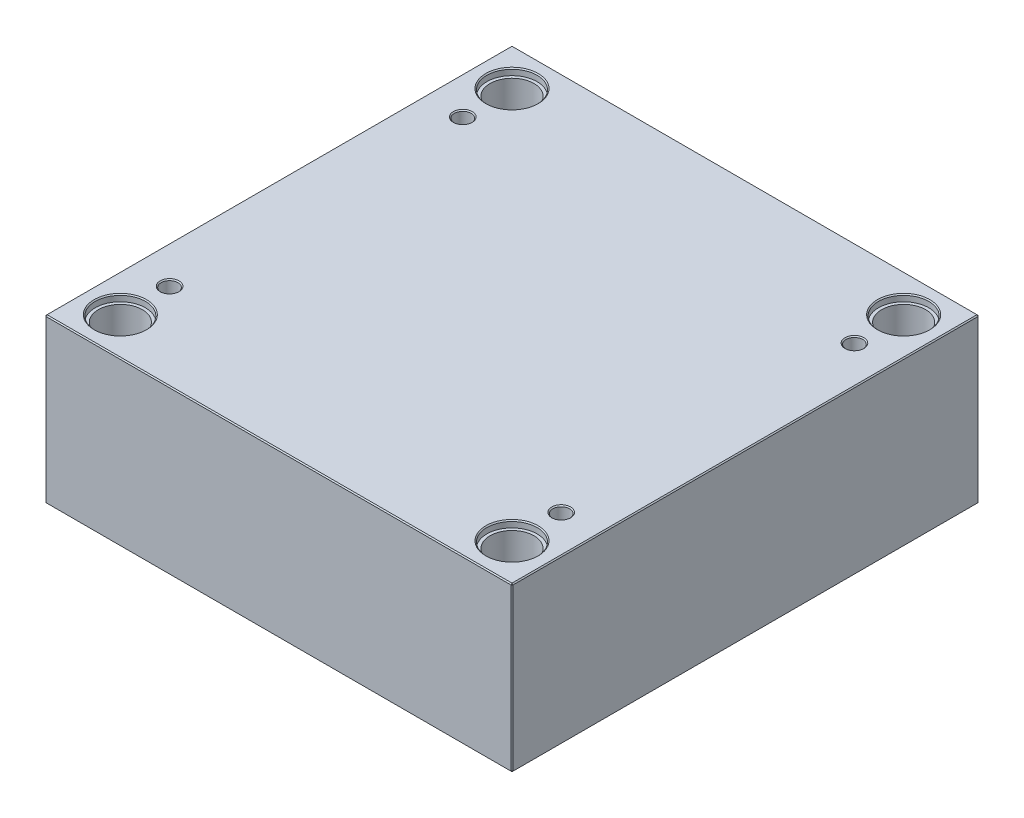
ISO-10303-21;
HEADER;
FILE_DESCRIPTION(('STEP AP214'),'2;1');
FILE_NAME('part.step','',(''),(''),'','','');
FILE_SCHEMA(('AUTOMOTIVE_DESIGN { 1 0 10303 214 1 1 1 1 }'));
ENDSEC;
DATA;
#1=APPLICATION_CONTEXT('core data for automotive mechanical design processes');
#2=APPLICATION_PROTOCOL_DEFINITION('international standard','automotive_design',2000,#1);
#3=PRODUCT_CONTEXT('',#1,'mechanical');
#4=PRODUCT('Part','Part','',(#3));
#5=PRODUCT_RELATED_PRODUCT_CATEGORY('part','',(#4));
#6=PRODUCT_DEFINITION_FORMATION('','',#4);
#7=PRODUCT_DEFINITION_CONTEXT('part definition',#1,'design');
#8=PRODUCT_DEFINITION('design','',#6,#7);
#9=PRODUCT_DEFINITION_SHAPE('','',#8);
#10=(LENGTH_UNIT() NAMED_UNIT(*) SI_UNIT(.MILLI.,.METRE.));
#11=(NAMED_UNIT(*) PLANE_ANGLE_UNIT() SI_UNIT($,.RADIAN.));
#12=(NAMED_UNIT(*) SI_UNIT($,.STERADIAN.) SOLID_ANGLE_UNIT());
#13=UNCERTAINTY_MEASURE_WITH_UNIT(LENGTH_MEASURE(1.E-05),#10,'distance_accuracy_value','');
#14=(GEOMETRIC_REPRESENTATION_CONTEXT(3) GLOBAL_UNCERTAINTY_ASSIGNED_CONTEXT((#13)) GLOBAL_UNIT_ASSIGNED_CONTEXT((#10,
#11,#12)) REPRESENTATION_CONTEXT('',''));
#15=CARTESIAN_POINT('',(0.,0.,0.));
#16=DIRECTION('',(0.,0.,1.));
#17=DIRECTION('',(1.,0.,0.));
#18=AXIS2_PLACEMENT_3D('',#15,#16,#17);
#19=CARTESIAN_POINT('',(-187.,0.,-187.));
#20=DIRECTION('',(0.,1.,0.));
#21=DIRECTION('',(0.,0.,1.));
#22=AXIS2_PLACEMENT_3D('',#19,#20,#21);
#23=CYLINDRICAL_SURFACE('',#22,21.);
#24=CARTESIAN_POINT('',(-187.,1.00000000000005,-187.));
#25=DIRECTION('',(0.,1.,0.));
#26=DIRECTION('',(0.,0.,1.));
#27=AXIS2_PLACEMENT_3D('',#24,#25,#26);
#28=CIRCLE('',#27,21.);
#29=CARTESIAN_POINT('',(-187.,1.00000000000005,-166.));
#30=VERTEX_POINT('',#29);
#31=EDGE_CURVE('E472',#30,#30,#28,.F.);
#32=ORIENTED_EDGE('',*,*,#31,.T.);
#33=EDGE_LOOP('',(#32));
#34=FACE_BOUND('',#33,.T.);
#35=CARTESIAN_POINT('',(-187.,149.7,-187.));
#36=DIRECTION('',(0.,1.,0.));
#37=DIRECTION('',(0.,0.,1.));
#38=AXIS2_PLACEMENT_3D('',#35,#36,#37);
#39=CIRCLE('',#38,21.);
#40=CARTESIAN_POINT('',(-187.,149.7,-166.));
#41=VERTEX_POINT('',#40);
#42=EDGE_CURVE('E221',#41,#41,#39,.F.);
#43=ORIENTED_EDGE('',*,*,#42,.F.);
#44=EDGE_LOOP('',(#43));
#45=FACE_BOUND('',#44,.T.);
#46=ADVANCED_FACE('F16',(#34,#45),#23,.F.);
#47=CARTESIAN_POINT('',(187.,0.,-187.));
#48=DIRECTION('',(0.,1.,0.));
#49=DIRECTION('',(0.,0.,1.));
#50=AXIS2_PLACEMENT_3D('',#47,#48,#49);
#51=CYLINDRICAL_SURFACE('',#50,21.);
#52=CARTESIAN_POINT('',(187.,1.00000000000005,-187.));
#53=DIRECTION('',(0.,1.,0.));
#54=DIRECTION('',(0.,0.,1.));
#55=AXIS2_PLACEMENT_3D('',#52,#53,#54);
#56=CIRCLE('',#55,21.);
#57=CARTESIAN_POINT('',(187.,1.00000000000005,-166.));
#58=VERTEX_POINT('',#57);
#59=EDGE_CURVE('E474',#58,#58,#56,.F.);
#60=ORIENTED_EDGE('',*,*,#59,.T.);
#61=EDGE_LOOP('',(#60));
#62=FACE_BOUND('',#61,.T.);
#63=CARTESIAN_POINT('',(187.,149.7,-187.));
#64=DIRECTION('',(0.,1.,0.));
#65=DIRECTION('',(0.,0.,1.));
#66=AXIS2_PLACEMENT_3D('',#63,#64,#65);
#67=CIRCLE('',#66,21.);
#68=CARTESIAN_POINT('',(187.,149.7,-166.));
#69=VERTEX_POINT('',#68);
#70=EDGE_CURVE('E218',#69,#69,#67,.F.);
#71=ORIENTED_EDGE('',*,*,#70,.F.);
#72=EDGE_LOOP('',(#71));
#73=FACE_BOUND('',#72,.T.);
#74=ADVANCED_FACE('F263',(#62,#73),#51,.F.);
#75=CARTESIAN_POINT('',(187.,0.,187.));
#76=DIRECTION('',(0.,1.,0.));
#77=DIRECTION('',(0.,0.,1.));
#78=AXIS2_PLACEMENT_3D('',#75,#76,#77);
#79=CYLINDRICAL_SURFACE('',#78,21.);
#80=CARTESIAN_POINT('',(187.,1.00000000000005,187.));
#81=DIRECTION('',(0.,1.,0.));
#82=DIRECTION('',(0.,0.,1.));
#83=AXIS2_PLACEMENT_3D('',#80,#81,#82);
#84=CIRCLE('',#83,21.);
#85=CARTESIAN_POINT('',(187.,1.00000000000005,208.));
#86=VERTEX_POINT('',#85);
#87=EDGE_CURVE('E477',#86,#86,#84,.F.);
#88=ORIENTED_EDGE('',*,*,#87,.T.);
#89=EDGE_LOOP('',(#88));
#90=FACE_BOUND('',#89,.T.);
#91=CARTESIAN_POINT('',(187.,149.7,187.));
#92=DIRECTION('',(0.,1.,0.));
#93=DIRECTION('',(0.,0.,1.));
#94=AXIS2_PLACEMENT_3D('',#91,#92,#93);
#95=CIRCLE('',#94,21.);
#96=CARTESIAN_POINT('',(187.,149.7,208.));
#97=VERTEX_POINT('',#96);
#98=EDGE_CURVE('E214',#97,#97,#95,.F.);
#99=ORIENTED_EDGE('',*,*,#98,.F.);
#100=EDGE_LOOP('',(#99));
#101=FACE_BOUND('',#100,.T.);
#102=ADVANCED_FACE('F270',(#90,#101),#79,.F.);
#103=CARTESIAN_POINT('',(-187.,0.,187.));
#104=DIRECTION('',(0.,1.,0.));
#105=DIRECTION('',(0.,0.,1.));
#106=AXIS2_PLACEMENT_3D('',#103,#104,#105);
#107=CYLINDRICAL_SURFACE('',#106,21.);
#108=CARTESIAN_POINT('',(-187.,1.00000000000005,187.));
#109=DIRECTION('',(0.,1.,0.));
#110=DIRECTION('',(0.,0.,1.));
#111=AXIS2_PLACEMENT_3D('',#108,#109,#110);
#112=CIRCLE('',#111,21.);
#113=CARTESIAN_POINT('',(-187.,1.00000000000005,208.));
#114=VERTEX_POINT('',#113);
#115=EDGE_CURVE('E480',#114,#114,#112,.F.);
#116=ORIENTED_EDGE('',*,*,#115,.T.);
#117=EDGE_LOOP('',(#116));
#118=FACE_BOUND('',#117,.T.);
#119=CARTESIAN_POINT('',(-187.,149.7,187.));
#120=DIRECTION('',(0.,1.,0.));
#121=DIRECTION('',(0.,0.,1.));
#122=AXIS2_PLACEMENT_3D('',#119,#120,#121);
#123=CIRCLE('',#122,21.);
#124=CARTESIAN_POINT('',(-187.,149.7,208.));
#125=VERTEX_POINT('',#124);
#126=EDGE_CURVE('E211',#125,#125,#123,.F.);
#127=ORIENTED_EDGE('',*,*,#126,.F.);
#128=EDGE_LOOP('',(#127));
#129=FACE_BOUND('',#128,.T.);
#130=ADVANCED_FACE('F277',(#118,#129),#107,.F.);
#131=CARTESIAN_POINT('',(-223.,156.,223.));
#132=DIRECTION('',(1.,0.,0.));
#133=DIRECTION('',(0.,0.,-1.));
#134=AXIS2_PLACEMENT_3D('',#131,#132,#133);
#135=PLANE('',#134);
#136=DIRECTION('',(0.,-1.,0.));
#137=VECTOR('',#136,1.);
#138=CARTESIAN_POINT('',(-223.,156.,-222.));
#139=LINE('',#138,#137);
#140=CARTESIAN_POINT('',(-223.,155.,-222.));
#141=VERTEX_POINT('',#140);
#142=CARTESIAN_POINT('',(-223.,1.00000000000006,-222.));
#143=VERTEX_POINT('',#142);
#144=EDGE_CURVE('E487',#141,#143,#139,.T.);
#145=ORIENTED_EDGE('',*,*,#144,.T.);
#146=DIRECTION('',(0.,0.,1.));
#147=VECTOR('',#146,1.);
#148=CARTESIAN_POINT('',(-223.,1.00000000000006,223.));
#149=LINE('',#148,#147);
#150=CARTESIAN_POINT('',(-223.,1.00000000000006,222.));
#151=VERTEX_POINT('',#150);
#152=EDGE_CURVE('E490',#143,#151,#149,.T.);
#153=ORIENTED_EDGE('',*,*,#152,.T.);
#154=DIRECTION('',(0.,1.,0.));
#155=VECTOR('',#154,1.);
#156=CARTESIAN_POINT('',(-223.,156.,222.));
#157=LINE('',#156,#155);
#158=CARTESIAN_POINT('',(-223.,155.,222.));
#159=VERTEX_POINT('',#158);
#160=EDGE_CURVE('E485',#151,#159,#157,.T.);
#161=ORIENTED_EDGE('',*,*,#160,.T.);
#162=DIRECTION('',(0.,0.,-1.));
#163=VECTOR('',#162,1.);
#164=CARTESIAN_POINT('',(-223.,155.,-223.));
#165=LINE('',#164,#163);
#166=EDGE_CURVE('E483',#159,#141,#165,.T.);
#167=ORIENTED_EDGE('',*,*,#166,.T.);
#168=EDGE_LOOP('',(#145,#153,#161,#167));
#169=FACE_BOUND('',#168,.T.);
#170=ADVANCED_FACE('F298',(#169),#135,.F.);
#171=CARTESIAN_POINT('',(223.,156.,223.));
#172=DIRECTION('',(0.,0.,-1.));
#173=DIRECTION('',(-1.,0.,0.));
#174=AXIS2_PLACEMENT_3D('',#171,#172,#173);
#175=PLANE('',#174);
#176=DIRECTION('',(-1.,0.,0.));
#177=VECTOR('',#176,1.);
#178=CARTESIAN_POINT('',(-223.,155.,223.));
#179=LINE('',#178,#177);
#180=CARTESIAN_POINT('',(222.,155.,223.));
#181=VERTEX_POINT('',#180);
#182=CARTESIAN_POINT('',(-222.,155.,223.));
#183=VERTEX_POINT('',#182);
#184=EDGE_CURVE('E509',#181,#183,#179,.T.);
#185=ORIENTED_EDGE('',*,*,#184,.T.);
#186=DIRECTION('',(0.,-1.,0.));
#187=VECTOR('',#186,1.);
#188=CARTESIAN_POINT('',(-222.,156.,223.));
#189=LINE('',#188,#187);
#190=CARTESIAN_POINT('',(-222.,1.,223.));
#191=VERTEX_POINT('',#190);
#192=EDGE_CURVE('E515',#183,#191,#189,.T.);
#193=ORIENTED_EDGE('',*,*,#192,.T.);
#194=DIRECTION('',(1.,0.,0.));
#195=VECTOR('',#194,1.);
#196=CARTESIAN_POINT('',(223.,1.,223.));
#197=LINE('',#196,#195);
#198=CARTESIAN_POINT('',(222.,1.,223.));
#199=VERTEX_POINT('',#198);
#200=EDGE_CURVE('E513',#191,#199,#197,.T.);
#201=ORIENTED_EDGE('',*,*,#200,.T.);
#202=DIRECTION('',(0.,1.,0.));
#203=VECTOR('',#202,1.);
#204=CARTESIAN_POINT('',(222.,156.,223.));
#205=LINE('',#204,#203);
#206=EDGE_CURVE('E511',#199,#181,#205,.T.);
#207=ORIENTED_EDGE('',*,*,#206,.T.);
#208=EDGE_LOOP('',(#185,#193,#201,#207));
#209=FACE_BOUND('',#208,.T.);
#210=ADVANCED_FACE('F294',(#209),#175,.F.);
#211=CARTESIAN_POINT('',(223.,156.,223.));
#212=DIRECTION('',(-1.,0.,0.));
#213=DIRECTION('',(0.,0.,1.));
#214=AXIS2_PLACEMENT_3D('',#211,#212,#213);
#215=PLANE('',#214);
#216=DIRECTION('',(0.,0.,-1.));
#217=VECTOR('',#216,1.);
#218=CARTESIAN_POINT('',(223.,1.,223.));
#219=LINE('',#218,#217);
#220=CARTESIAN_POINT('',(223.,1.,222.));
#221=VERTEX_POINT('',#220);
#222=CARTESIAN_POINT('',(223.,1.,-222.));
#223=VERTEX_POINT('',#222);
#224=EDGE_CURVE('E504',#221,#223,#219,.T.);
#225=ORIENTED_EDGE('',*,*,#224,.T.);
#226=DIRECTION('',(0.,1.,0.));
#227=VECTOR('',#226,1.);
#228=CARTESIAN_POINT('',(223.,156.,-222.));
#229=LINE('',#228,#227);
#230=CARTESIAN_POINT('',(223.,155.,-222.));
#231=VERTEX_POINT('',#230);
#232=EDGE_CURVE('E506',#223,#231,#229,.T.);
#233=ORIENTED_EDGE('',*,*,#232,.T.);
#234=DIRECTION('',(0.,0.,1.));
#235=VECTOR('',#234,1.);
#236=CARTESIAN_POINT('',(223.,155.,223.));
#237=LINE('',#236,#235);
#238=CARTESIAN_POINT('',(223.,155.,222.));
#239=VERTEX_POINT('',#238);
#240=EDGE_CURVE('E500',#231,#239,#237,.T.);
#241=ORIENTED_EDGE('',*,*,#240,.T.);
#242=DIRECTION('',(0.,-1.,0.));
#243=VECTOR('',#242,1.);
#244=CARTESIAN_POINT('',(223.,156.,222.));
#245=LINE('',#244,#243);
#246=EDGE_CURVE('E502',#239,#221,#245,.T.);
#247=ORIENTED_EDGE('',*,*,#246,.T.);
#248=EDGE_LOOP('',(#225,#233,#241,#247));
#249=FACE_BOUND('',#248,.T.);
#250=ADVANCED_FACE('F290',(#249),#215,.F.);
#251=CARTESIAN_POINT('',(223.,156.,-223.));
#252=DIRECTION('',(0.,0.,1.));
#253=DIRECTION('',(1.,0.,0.));
#254=AXIS2_PLACEMENT_3D('',#251,#252,#253);
#255=PLANE('',#254);
#256=DIRECTION('',(0.,-1.,0.));
#257=VECTOR('',#256,1.);
#258=CARTESIAN_POINT('',(222.,156.,-223.));
#259=LINE('',#258,#257);
#260=CARTESIAN_POINT('',(222.,155.,-223.));
#261=VERTEX_POINT('',#260);
#262=CARTESIAN_POINT('',(222.,1.,-223.));
#263=VERTEX_POINT('',#262);
#264=EDGE_CURVE('E494',#261,#263,#259,.T.);
#265=ORIENTED_EDGE('',*,*,#264,.T.);
#266=DIRECTION('',(-1.,0.,0.));
#267=VECTOR('',#266,1.);
#268=CARTESIAN_POINT('',(223.,1.,-223.));
#269=LINE('',#268,#267);
#270=CARTESIAN_POINT('',(-222.,1.,-223.));
#271=VERTEX_POINT('',#270);
#272=EDGE_CURVE('E138',#263,#271,#269,.T.);
#273=ORIENTED_EDGE('',*,*,#272,.T.);
#274=DIRECTION('',(0.,1.,0.));
#275=VECTOR('',#274,1.);
#276=CARTESIAN_POINT('',(-222.,156.,-223.));
#277=LINE('',#276,#275);
#278=CARTESIAN_POINT('',(-222.,155.,-223.));
#279=VERTEX_POINT('',#278);
#280=EDGE_CURVE('E496',#271,#279,#277,.T.);
#281=ORIENTED_EDGE('',*,*,#280,.T.);
#282=DIRECTION('',(1.,0.,0.));
#283=VECTOR('',#282,1.);
#284=CARTESIAN_POINT('',(223.,155.,-223.));
#285=LINE('',#284,#283);
#286=EDGE_CURVE('E492',#279,#261,#285,.T.);
#287=ORIENTED_EDGE('',*,*,#286,.T.);
#288=EDGE_LOOP('',(#265,#273,#281,#287));
#289=FACE_BOUND('',#288,.T.);
#290=ADVANCED_FACE('F282',(#289),#255,.F.);
#291=CARTESIAN_POINT('',(0.,156.,0.));
#292=DIRECTION('',(0.,1.,0.));
#293=DIRECTION('',(0.,0.,1.));
#294=AXIS2_PLACEMENT_3D('',#291,#292,#293);
#295=PLANE('',#294);
#296=CARTESIAN_POINT('',(187.,156.,187.));
#297=DIRECTION('',(0.,1.,0.));
#298=DIRECTION('',(0.,0.,1.));
#299=AXIS2_PLACEMENT_3D('',#296,#297,#298);
#300=CIRCLE('',#299,25.);
#301=CARTESIAN_POINT('',(187.,156.,212.));
#302=VERTEX_POINT('',#301);
#303=EDGE_CURVE('E236',#302,#302,#300,.F.);
#304=ORIENTED_EDGE('',*,*,#303,.T.);
#305=EDGE_LOOP('',(#304));
#306=FACE_BOUND('',#305,.T.);
#307=CARTESIAN_POINT('',(-187.,156.,187.));
#308=DIRECTION('',(0.,1.,0.));
#309=DIRECTION('',(0.,0.,1.));
#310=AXIS2_PLACEMENT_3D('',#307,#308,#309);
#311=CIRCLE('',#310,25.);
#312=CARTESIAN_POINT('',(-187.,156.,212.));
#313=VERTEX_POINT('',#312);
#314=EDGE_CURVE('E233',#313,#313,#311,.F.);
#315=ORIENTED_EDGE('',*,*,#314,.T.);
#316=EDGE_LOOP('',(#315));
#317=FACE_BOUND('',#316,.T.);
#318=CARTESIAN_POINT('',(187.,156.,-187.));
#319=DIRECTION('',(0.,1.,0.));
#320=DIRECTION('',(0.,0.,1.));
#321=AXIS2_PLACEMENT_3D('',#318,#319,#320);
#322=CIRCLE('',#321,25.);
#323=CARTESIAN_POINT('',(187.,156.,-162.));
#324=VERTEX_POINT('',#323);
#325=EDGE_CURVE('E230',#324,#324,#322,.F.);
#326=ORIENTED_EDGE('',*,*,#325,.T.);
#327=EDGE_LOOP('',(#326));
#328=FACE_BOUND('',#327,.T.);
#329=CARTESIAN_POINT('',(-187.,156.,-187.));
#330=DIRECTION('',(0.,1.,0.));
#331=DIRECTION('',(0.,0.,1.));
#332=AXIS2_PLACEMENT_3D('',#329,#330,#331);
#333=CIRCLE('',#332,25.);
#334=CARTESIAN_POINT('',(-187.,156.,-162.));
#335=VERTEX_POINT('',#334);
#336=EDGE_CURVE('E227',#335,#335,#333,.F.);
#337=ORIENTED_EDGE('',*,*,#336,.T.);
#338=EDGE_LOOP('',(#337));
#339=FACE_BOUND('',#338,.T.);
#340=CARTESIAN_POINT('',(-187.,156.,140.));
#341=DIRECTION('',(0.,1.,0.));
#342=DIRECTION('',(0.,0.,1.));
#343=AXIS2_PLACEMENT_3D('',#340,#341,#342);
#344=CIRCLE('',#343,9.);
#345=CARTESIAN_POINT('',(-187.,156.,149.));
#346=VERTEX_POINT('',#345);
#347=EDGE_CURVE('E198',#346,#346,#344,.F.);
#348=ORIENTED_EDGE('',*,*,#347,.T.);
#349=EDGE_LOOP('',(#348));
#350=FACE_BOUND('',#349,.T.);
#351=CARTESIAN_POINT('',(187.,156.,140.));
#352=DIRECTION('',(0.,1.,0.));
#353=DIRECTION('',(0.,0.,1.));
#354=AXIS2_PLACEMENT_3D('',#351,#352,#353);
#355=CIRCLE('',#354,9.);
#356=CARTESIAN_POINT('',(187.,156.,149.));
#357=VERTEX_POINT('',#356);
#358=EDGE_CURVE('E195',#357,#357,#355,.F.);
#359=ORIENTED_EDGE('',*,*,#358,.T.);
#360=EDGE_LOOP('',(#359));
#361=FACE_BOUND('',#360,.T.);
#362=CARTESIAN_POINT('',(187.,156.,-140.));
#363=DIRECTION('',(0.,1.,0.));
#364=DIRECTION('',(0.,0.,1.));
#365=AXIS2_PLACEMENT_3D('',#362,#363,#364);
#366=CIRCLE('',#365,9.);
#367=CARTESIAN_POINT('',(187.,156.,-131.));
#368=VERTEX_POINT('',#367);
#369=EDGE_CURVE('E192',#368,#368,#366,.F.);
#370=ORIENTED_EDGE('',*,*,#369,.T.);
#371=EDGE_LOOP('',(#370));
#372=FACE_BOUND('',#371,.T.);
#373=CARTESIAN_POINT('',(-187.,156.,-140.));
#374=DIRECTION('',(0.,1.,0.));
#375=DIRECTION('',(0.,0.,1.));
#376=AXIS2_PLACEMENT_3D('',#373,#374,#375);
#377=CIRCLE('',#376,9.);
#378=CARTESIAN_POINT('',(-187.,156.,-131.));
#379=VERTEX_POINT('',#378);
#380=EDGE_CURVE('E188',#379,#379,#377,.F.);
#381=ORIENTED_EDGE('',*,*,#380,.T.);
#382=EDGE_LOOP('',(#381));
#383=FACE_BOUND('',#382,.T.);
#384=DIRECTION('',(0.,0.,-1.));
#385=VECTOR('',#384,1.);
#386=CARTESIAN_POINT('',(222.,156.,-223.));
#387=LINE('',#386,#385);
#388=CARTESIAN_POINT('',(222.,156.,222.));
#389=VERTEX_POINT('',#388);
#390=CARTESIAN_POINT('',(222.,156.,-222.));
#391=VERTEX_POINT('',#390);
#392=EDGE_CURVE('E31',#389,#391,#387,.T.);
#393=ORIENTED_EDGE('',*,*,#392,.T.);
#394=DIRECTION('',(-1.,0.,0.));
#395=VECTOR('',#394,1.);
#396=CARTESIAN_POINT('',(-223.,156.,-222.));
#397=LINE('',#396,#395);
#398=CARTESIAN_POINT('',(-222.,156.,-222.));
#399=VERTEX_POINT('',#398);
#400=EDGE_CURVE('E189',#391,#399,#397,.T.);
#401=ORIENTED_EDGE('',*,*,#400,.T.);
#402=DIRECTION('',(0.,0.,1.));
#403=VECTOR('',#402,1.);
#404=CARTESIAN_POINT('',(-222.,156.,223.));
#405=LINE('',#404,#403);
#406=CARTESIAN_POINT('',(-222.,156.,222.));
#407=VERTEX_POINT('',#406);
#408=EDGE_CURVE('E518',#399,#407,#405,.T.);
#409=ORIENTED_EDGE('',*,*,#408,.T.);
#410=DIRECTION('',(1.,0.,0.));
#411=VECTOR('',#410,1.);
#412=CARTESIAN_POINT('',(223.,156.,222.));
#413=LINE('',#412,#411);
#414=EDGE_CURVE('E36',#407,#389,#413,.T.);
#415=ORIENTED_EDGE('',*,*,#414,.T.);
#416=EDGE_LOOP('',(#393,#401,#409,#415));
#417=FACE_BOUND('',#416,.T.);
#418=ADVANCED_FACE('F279',(#306,#317,#328,#339,#350,#361,#372,#383,#417),#295,.T.);
#419=CARTESIAN_POINT('',(0.,0.,0.));
#420=DIRECTION('',(0.,1.,0.));
#421=DIRECTION('',(0.,0.,1.));
#422=AXIS2_PLACEMENT_3D('',#419,#420,#421);
#423=PLANE('',#422);
#424=CARTESIAN_POINT('',(-187.,0.,-187.));
#425=DIRECTION('',(0.,1.,0.));
#426=DIRECTION('',(0.,0.,1.));
#427=AXIS2_PLACEMENT_3D('',#424,#425,#426);
#428=CIRCLE('',#427,22.);
#429=CARTESIAN_POINT('',(-187.,0.,-165.));
#430=VERTEX_POINT('',#429);
#431=EDGE_CURVE('E469',#430,#430,#428,.T.);
#432=ORIENTED_EDGE('',*,*,#431,.T.);
#433=EDGE_LOOP('',(#432));
#434=FACE_BOUND('',#433,.T.);
#435=CARTESIAN_POINT('',(187.,0.,-187.));
#436=DIRECTION('',(0.,1.,0.));
#437=DIRECTION('',(0.,0.,1.));
#438=AXIS2_PLACEMENT_3D('',#435,#436,#437);
#439=CIRCLE('',#438,22.);
#440=CARTESIAN_POINT('',(187.,0.,-165.));
#441=VERTEX_POINT('',#440);
#442=EDGE_CURVE('E466',#441,#441,#439,.T.);
#443=ORIENTED_EDGE('',*,*,#442,.T.);
#444=EDGE_LOOP('',(#443));
#445=FACE_BOUND('',#444,.T.);
#446=CARTESIAN_POINT('',(187.,0.,187.));
#447=DIRECTION('',(0.,1.,0.));
#448=DIRECTION('',(0.,0.,1.));
#449=AXIS2_PLACEMENT_3D('',#446,#447,#448);
#450=CIRCLE('',#449,22.);
#451=CARTESIAN_POINT('',(187.,0.,209.));
#452=VERTEX_POINT('',#451);
#453=EDGE_CURVE('E463',#452,#452,#450,.T.);
#454=ORIENTED_EDGE('',*,*,#453,.T.);
#455=EDGE_LOOP('',(#454));
#456=FACE_BOUND('',#455,.T.);
#457=CARTESIAN_POINT('',(-187.,0.,187.));
#458=DIRECTION('',(0.,1.,0.));
#459=DIRECTION('',(0.,0.,1.));
#460=AXIS2_PLACEMENT_3D('',#457,#458,#459);
#461=CIRCLE('',#460,22.);
#462=CARTESIAN_POINT('',(-187.,0.,209.));
#463=VERTEX_POINT('',#462);
#464=EDGE_CURVE('E460',#463,#463,#461,.T.);
#465=ORIENTED_EDGE('',*,*,#464,.T.);
#466=EDGE_LOOP('',(#465));
#467=FACE_BOUND('',#466,.T.);
#468=DIRECTION('',(0.,0.,1.));
#469=VECTOR('',#468,1.);
#470=CARTESIAN_POINT('',(222.,0.,0.));
#471=LINE('',#470,#469);
#472=CARTESIAN_POINT('',(222.,0.,-222.));
#473=VERTEX_POINT('',#472);
#474=CARTESIAN_POINT('',(222.,0.,222.));
#475=VERTEX_POINT('',#474);
#476=EDGE_CURVE('E108',#473,#475,#471,.T.);
#477=ORIENTED_EDGE('',*,*,#476,.T.);
#478=DIRECTION('',(-1.,0.,0.));
#479=VECTOR('',#478,1.);
#480=CARTESIAN_POINT('',(0.,0.,222.));
#481=LINE('',#480,#479);
#482=CARTESIAN_POINT('',(-222.,0.,222.));
#483=VERTEX_POINT('',#482);
#484=EDGE_CURVE('E458',#475,#483,#481,.T.);
#485=ORIENTED_EDGE('',*,*,#484,.T.);
#486=DIRECTION('',(0.,0.,-1.));
#487=VECTOR('',#486,1.);
#488=CARTESIAN_POINT('',(-222.,0.,0.));
#489=LINE('',#488,#487);
#490=CARTESIAN_POINT('',(-222.,0.,-222.));
#491=VERTEX_POINT('',#490);
#492=EDGE_CURVE('E110',#483,#491,#489,.T.);
#493=ORIENTED_EDGE('',*,*,#492,.T.);
#494=DIRECTION('',(1.,0.,0.));
#495=VECTOR('',#494,1.);
#496=CARTESIAN_POINT('',(0.,0.,-222.));
#497=LINE('',#496,#495);
#498=EDGE_CURVE('E104',#491,#473,#497,.T.);
#499=ORIENTED_EDGE('',*,*,#498,.T.);
#500=EDGE_LOOP('',(#477,#485,#493,#499));
#501=FACE_BOUND('',#500,.T.);
#502=ADVANCED_FACE('F106',(#434,#445,#456,#467,#501),#423,.F.);
#503=CARTESIAN_POINT('',(-187.,0.,-187.));
#504=DIRECTION('',(0.,-1.,0.));
#505=DIRECTION('',(0.,0.,-1.));
#506=AXIS2_PLACEMENT_3D('',#503,#504,#505);
#507=CONICAL_SURFACE('',#506,22.,0.785398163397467);
#508=ORIENTED_EDGE('',*,*,#31,.F.);
#509=EDGE_LOOP('',(#508));
#510=FACE_BOUND('',#509,.T.);
#511=ORIENTED_EDGE('',*,*,#431,.F.);
#512=EDGE_LOOP('',(#511));
#513=FACE_BOUND('',#512,.T.);
#514=ADVANCED_FACE('F286',(#510,#513),#507,.F.);
#515=CARTESIAN_POINT('',(187.,0.,-187.));
#516=DIRECTION('',(0.,-1.,0.));
#517=DIRECTION('',(0.,0.,-1.));
#518=AXIS2_PLACEMENT_3D('',#515,#516,#517);
#519=CONICAL_SURFACE('',#518,22.,0.785398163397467);
#520=ORIENTED_EDGE('',*,*,#59,.F.);
#521=EDGE_LOOP('',(#520));
#522=FACE_BOUND('',#521,.T.);
#523=ORIENTED_EDGE('',*,*,#442,.F.);
#524=EDGE_LOOP('',(#523));
#525=FACE_BOUND('',#524,.T.);
#526=ADVANCED_FACE('F305',(#522,#525),#519,.F.);
#527=CARTESIAN_POINT('',(187.,0.,187.));
#528=DIRECTION('',(0.,-1.,0.));
#529=DIRECTION('',(0.,0.,-1.));
#530=AXIS2_PLACEMENT_3D('',#527,#528,#529);
#531=CONICAL_SURFACE('',#530,22.,0.785398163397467);
#532=ORIENTED_EDGE('',*,*,#87,.F.);
#533=EDGE_LOOP('',(#532));
#534=FACE_BOUND('',#533,.T.);
#535=ORIENTED_EDGE('',*,*,#453,.F.);
#536=EDGE_LOOP('',(#535));
#537=FACE_BOUND('',#536,.T.);
#538=ADVANCED_FACE('F309',(#534,#537),#531,.F.);
#539=CARTESIAN_POINT('',(-187.,0.,187.));
#540=DIRECTION('',(0.,-1.,0.));
#541=DIRECTION('',(0.,0.,-1.));
#542=AXIS2_PLACEMENT_3D('',#539,#540,#541);
#543=CONICAL_SURFACE('',#542,22.,0.785398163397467);
#544=ORIENTED_EDGE('',*,*,#115,.F.);
#545=EDGE_LOOP('',(#544));
#546=FACE_BOUND('',#545,.T.);
#547=ORIENTED_EDGE('',*,*,#464,.F.);
#548=EDGE_LOOP('',(#547));
#549=FACE_BOUND('',#548,.T.);
#550=ADVANCED_FACE('F313',(#546,#549),#543,.F.);
#551=CARTESIAN_POINT('',(223.,156.,222.));
#552=DIRECTION('',(-0.707106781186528,0.,-0.707106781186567));
#553=DIRECTION('',(0.,-1.,0.));
#554=AXIS2_PLACEMENT_3D('',#551,#552,#553);
#555=PLANE('',#554);
#556=DIRECTION('',(-0.707106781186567,0.,0.707106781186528));
#557=VECTOR('',#556,1.);
#558=CARTESIAN_POINT('',(222.,155.,223.));
#559=LINE('',#558,#557);
#560=EDGE_CURVE('E126',#181,#239,#559,.F.);
#561=ORIENTED_EDGE('',*,*,#560,.F.);
#562=ORIENTED_EDGE('',*,*,#206,.F.);
#563=DIRECTION('',(0.707106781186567,0.,-0.707106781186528));
#564=VECTOR('',#563,1.);
#565=CARTESIAN_POINT('',(222.,1.,223.));
#566=LINE('',#565,#564);
#567=EDGE_CURVE('E180',#221,#199,#566,.F.);
#568=ORIENTED_EDGE('',*,*,#567,.F.);
#569=ORIENTED_EDGE('',*,*,#246,.F.);
#570=EDGE_LOOP('',(#561,#562,#568,#569));
#571=FACE_BOUND('',#570,.T.);
#572=ADVANCED_FACE('F317',(#571),#555,.F.);
#573=CARTESIAN_POINT('',(222.,155.,223.));
#574=DIRECTION('',(0.577350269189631,0.577350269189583,0.577350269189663));
#575=DIRECTION('',(0.707106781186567,0.,-0.707106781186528));
#576=AXIS2_PLACEMENT_3D('',#573,#574,#575);
#577=PLANE('',#576);
#578=DIRECTION('',(0.,-0.707106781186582,0.707106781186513));
#579=VECTOR('',#578,1.);
#580=CARTESIAN_POINT('',(222.,155.,223.));
#581=LINE('',#580,#579);
#582=EDGE_CURVE('E175',#181,#389,#581,.F.);
#583=ORIENTED_EDGE('',*,*,#582,.F.);
#584=ORIENTED_EDGE('',*,*,#560,.T.);
#585=DIRECTION('',(-0.707106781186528,0.707106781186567,0.));
#586=VECTOR('',#585,1.);
#587=CARTESIAN_POINT('',(222.5,155.5,222.));
#588=LINE('',#587,#586);
#589=EDGE_CURVE('E177',#389,#239,#588,.F.);
#590=ORIENTED_EDGE('',*,*,#589,.F.);
#591=EDGE_LOOP('',(#583,#584,#590));
#592=FACE_BOUND('',#591,.T.);
#593=ADVANCED_FACE('F385',(#592),#577,.T.);
#594=CARTESIAN_POINT('',(222.,1.,223.));
#595=DIRECTION('',(0.577350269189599,-0.577350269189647,0.577350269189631));
#596=DIRECTION('',(0.,-0.707106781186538,-0.707106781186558));
#597=AXIS2_PLACEMENT_3D('',#594,#595,#596);
#598=PLANE('',#597);
#599=DIRECTION('',(-0.707106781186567,-0.707106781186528,0.));
#600=VECTOR('',#599,1.);
#601=CARTESIAN_POINT('',(222.5,0.499999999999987,222.));
#602=LINE('',#601,#600);
#603=EDGE_CURVE('E124',#221,#475,#602,.T.);
#604=ORIENTED_EDGE('',*,*,#603,.F.);
#605=ORIENTED_EDGE('',*,*,#567,.T.);
#606=DIRECTION('',(0.,0.707106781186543,0.707106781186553));
#607=VECTOR('',#606,1.);
#608=CARTESIAN_POINT('',(222.,1.,223.));
#609=LINE('',#608,#607);
#610=EDGE_CURVE('E172',#475,#199,#609,.T.);
#611=ORIENTED_EDGE('',*,*,#610,.F.);
#612=EDGE_LOOP('',(#604,#605,#611));
#613=FACE_BOUND('',#612,.T.);
#614=ADVANCED_FACE('F381',(#613),#598,.T.);
#615=CARTESIAN_POINT('',(222.,156.,0.));
#616=DIRECTION('',(0.707106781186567,0.707106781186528,0.));
#617=DIRECTION('',(0.,0.,1.));
#618=AXIS2_PLACEMENT_3D('',#615,#616,#617);
#619=PLANE('',#618);
#620=ORIENTED_EDGE('',*,*,#589,.T.);
#621=ORIENTED_EDGE('',*,*,#240,.F.);
#622=DIRECTION('',(0.707106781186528,-0.707106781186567,0.));
#623=VECTOR('',#622,1.);
#624=CARTESIAN_POINT('',(223.,155.,-222.));
#625=LINE('',#624,#623);
#626=EDGE_CURVE('E166',#391,#231,#625,.T.);
#627=ORIENTED_EDGE('',*,*,#626,.F.);
#628=ORIENTED_EDGE('',*,*,#392,.F.);
#629=EDGE_LOOP('',(#620,#621,#627,#628));
#630=FACE_BOUND('',#629,.T.);
#631=ADVANCED_FACE('F377',(#630),#619,.T.);
#632=CARTESIAN_POINT('',(0.,156.,222.));
#633=DIRECTION('',(0.,0.707106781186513,0.707106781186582));
#634=DIRECTION('',(-1.,0.,0.));
#635=AXIS2_PLACEMENT_3D('',#632,#633,#634);
#636=PLANE('',#635);
#637=ORIENTED_EDGE('',*,*,#582,.T.);
#638=ORIENTED_EDGE('',*,*,#414,.F.);
#639=DIRECTION('',(0.,0.707106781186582,-0.707106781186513));
#640=VECTOR('',#639,1.);
#641=CARTESIAN_POINT('',(-222.,155.5,222.5));
#642=LINE('',#641,#640);
#643=EDGE_CURVE('E163',#183,#407,#642,.T.);
#644=ORIENTED_EDGE('',*,*,#643,.F.);
#645=ORIENTED_EDGE('',*,*,#184,.F.);
#646=EDGE_LOOP('',(#637,#638,#644,#645));
#647=FACE_BOUND('',#646,.T.);
#648=ADVANCED_FACE('F373',(#647),#636,.T.);
#649=CARTESIAN_POINT('',(-222.,156.,223.));
#650=DIRECTION('',(0.707106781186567,0.,-0.707106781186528));
#651=DIRECTION('',(0.,-1.,0.));
#652=AXIS2_PLACEMENT_3D('',#649,#650,#651);
#653=PLANE('',#652);
#654=DIRECTION('',(0.707106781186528,0.,0.707106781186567));
#655=VECTOR('',#654,1.);
#656=CARTESIAN_POINT('',(-222.,1.,223.));
#657=LINE('',#656,#655);
#658=EDGE_CURVE('E157',#191,#151,#657,.F.);
#659=ORIENTED_EDGE('',*,*,#658,.F.);
#660=ORIENTED_EDGE('',*,*,#192,.F.);
#661=DIRECTION('',(-0.707106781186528,0.,-0.707106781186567));
#662=VECTOR('',#661,1.);
#663=CARTESIAN_POINT('',(-223.,155.,222.));
#664=LINE('',#663,#662);
#665=EDGE_CURVE('E160',#159,#183,#664,.F.);
#666=ORIENTED_EDGE('',*,*,#665,.F.);
#667=ORIENTED_EDGE('',*,*,#160,.F.);
#668=EDGE_LOOP('',(#659,#660,#666,#667));
#669=FACE_BOUND('',#668,.T.);
#670=ADVANCED_FACE('F369',(#669),#653,.F.);
#671=CARTESIAN_POINT('',(223.,1.,223.));
#672=DIRECTION('',(0.,0.707106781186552,-0.707106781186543));
#673=DIRECTION('',(1.,0.,0.));
#674=AXIS2_PLACEMENT_3D('',#671,#672,#673);
#675=PLANE('',#674);
#676=ORIENTED_EDGE('',*,*,#610,.T.);
#677=ORIENTED_EDGE('',*,*,#200,.F.);
#678=DIRECTION('',(0.,-0.707106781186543,-0.707106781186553));
#679=VECTOR('',#678,1.);
#680=CARTESIAN_POINT('',(-222.,1.,223.));
#681=LINE('',#680,#679);
#682=EDGE_CURVE('E135',#483,#191,#681,.F.);
#683=ORIENTED_EDGE('',*,*,#682,.F.);
#684=ORIENTED_EDGE('',*,*,#484,.F.);
#685=EDGE_LOOP('',(#676,#677,#683,#684));
#686=FACE_BOUND('',#685,.T.);
#687=ADVANCED_FACE('F366',(#686),#675,.F.);
#688=CARTESIAN_POINT('',(223.,1.,223.));
#689=DIRECTION('',(-0.707106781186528,0.707106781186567,0.));
#690=DIRECTION('',(0.,0.,-1.));
#691=AXIS2_PLACEMENT_3D('',#688,#689,#690);
#692=PLANE('',#691);
#693=ORIENTED_EDGE('',*,*,#603,.T.);
#694=ORIENTED_EDGE('',*,*,#476,.F.);
#695=DIRECTION('',(0.707106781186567,0.707106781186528,0.));
#696=VECTOR('',#695,1.);
#697=CARTESIAN_POINT('',(222.5,0.500000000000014,-222.));
#698=LINE('',#697,#696);
#699=EDGE_CURVE('E121',#223,#473,#698,.F.);
#700=ORIENTED_EDGE('',*,*,#699,.F.);
#701=ORIENTED_EDGE('',*,*,#224,.F.);
#702=EDGE_LOOP('',(#693,#694,#700,#701));
#703=FACE_BOUND('',#702,.T.);
#704=ADVANCED_FACE('F119',(#703),#692,.F.);
#705=CARTESIAN_POINT('',(222.,156.,-223.));
#706=DIRECTION('',(-0.707106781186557,0.,0.707106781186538));
#707=DIRECTION('',(0.,-1.,0.));
#708=AXIS2_PLACEMENT_3D('',#705,#706,#707);
#709=PLANE('',#708);
#710=DIRECTION('',(0.707106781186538,0.,0.707106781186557));
#711=VECTOR('',#710,1.);
#712=CARTESIAN_POINT('',(223.,155.,-222.));
#713=LINE('',#712,#711);
#714=EDGE_CURVE('E168',#231,#261,#713,.F.);
#715=ORIENTED_EDGE('',*,*,#714,.F.);
#716=ORIENTED_EDGE('',*,*,#232,.F.);
#717=DIRECTION('',(-0.707106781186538,0.,-0.707106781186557));
#718=VECTOR('',#717,1.);
#719=CARTESIAN_POINT('',(222.,1.,-223.));
#720=LINE('',#719,#718);
#721=EDGE_CURVE('E134',#263,#223,#720,.F.);
#722=ORIENTED_EDGE('',*,*,#721,.F.);
#723=ORIENTED_EDGE('',*,*,#264,.F.);
#724=EDGE_LOOP('',(#715,#716,#722,#723));
#725=FACE_BOUND('',#724,.T.);
#726=ADVANCED_FACE('F359',(#725),#709,.F.);
#727=CARTESIAN_POINT('',(223.,155.,-222.));
#728=DIRECTION('',(0.577350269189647,0.577350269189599,-0.577350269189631));
#729=DIRECTION('',(-0.707106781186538,0.,-0.707106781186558));
#730=AXIS2_PLACEMENT_3D('',#727,#728,#729);
#731=PLANE('',#730);
#732=ORIENTED_EDGE('',*,*,#626,.T.);
#733=ORIENTED_EDGE('',*,*,#714,.T.);
#734=DIRECTION('',(0.,0.707106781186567,0.707106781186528));
#735=VECTOR('',#734,1.);
#736=CARTESIAN_POINT('',(222.,155.5,-222.5));
#737=LINE('',#736,#735);
#738=EDGE_CURVE('E152',#391,#261,#737,.F.);
#739=ORIENTED_EDGE('',*,*,#738,.F.);
#740=EDGE_LOOP('',(#732,#733,#739));
#741=FACE_BOUND('',#740,.T.);
#742=ADVANCED_FACE('F355',(#741),#731,.T.);
#743=CARTESIAN_POINT('',(-223.,155.,222.));
#744=DIRECTION('',(-0.577350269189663,0.577350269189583,0.577350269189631));
#745=DIRECTION('',(0.707106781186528,0.,0.707106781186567));
#746=AXIS2_PLACEMENT_3D('',#743,#744,#745);
#747=PLANE('',#746);
#748=ORIENTED_EDGE('',*,*,#665,.T.);
#749=ORIENTED_EDGE('',*,*,#643,.T.);
#750=DIRECTION('',(-0.707106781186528,-0.707106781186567,0.));
#751=VECTOR('',#750,1.);
#752=CARTESIAN_POINT('',(-223.,155.,222.));
#753=LINE('',#752,#751);
#754=EDGE_CURVE('E143',#159,#407,#753,.F.);
#755=ORIENTED_EDGE('',*,*,#754,.F.);
#756=EDGE_LOOP('',(#748,#749,#755));
#757=FACE_BOUND('',#756,.T.);
#758=ADVANCED_FACE('F351',(#757),#747,.T.);
#759=CARTESIAN_POINT('',(-222.,1.,223.));
#760=DIRECTION('',(-0.577350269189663,-0.577350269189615,0.577350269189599));
#761=DIRECTION('',(0.707106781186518,-0.707106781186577,0.));
#762=AXIS2_PLACEMENT_3D('',#759,#760,#761);
#763=PLANE('',#762);
#764=ORIENTED_EDGE('',*,*,#682,.T.);
#765=ORIENTED_EDGE('',*,*,#658,.T.);
#766=DIRECTION('',(-0.707106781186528,0.707106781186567,0.));
#767=VECTOR('',#766,1.);
#768=CARTESIAN_POINT('',(-222.5,0.500000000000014,222.));
#769=LINE('',#768,#767);
#770=EDGE_CURVE('E139',#483,#151,#769,.T.);
#771=ORIENTED_EDGE('',*,*,#770,.F.);
#772=EDGE_LOOP('',(#764,#765,#771));
#773=FACE_BOUND('',#772,.T.);
#774=ADVANCED_FACE('F348',(#773),#763,.T.);
#775=CARTESIAN_POINT('',(222.,1.,-223.));
#776=DIRECTION('',(0.577350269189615,-0.577350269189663,-0.577350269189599));
#777=DIRECTION('',(0.707106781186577,0.707106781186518,0.));
#778=AXIS2_PLACEMENT_3D('',#775,#776,#777);
#779=PLANE('',#778);
#780=ORIENTED_EDGE('',*,*,#721,.T.);
#781=ORIENTED_EDGE('',*,*,#699,.T.);
#782=DIRECTION('',(0.,-0.707106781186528,0.707106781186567));
#783=VECTOR('',#782,1.);
#784=CARTESIAN_POINT('',(222.,1.,-223.));
#785=LINE('',#784,#783);
#786=EDGE_CURVE('E131',#263,#473,#785,.T.);
#787=ORIENTED_EDGE('',*,*,#786,.F.);
#788=EDGE_LOOP('',(#780,#781,#787));
#789=FACE_BOUND('',#788,.T.);
#790=ADVANCED_FACE('F130',(#789),#779,.T.);
#791=CARTESIAN_POINT('',(0.,156.,-222.));
#792=DIRECTION('',(0.,0.707106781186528,-0.707106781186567));
#793=DIRECTION('',(1.,0.,0.));
#794=AXIS2_PLACEMENT_3D('',#791,#792,#793);
#795=PLANE('',#794);
#796=ORIENTED_EDGE('',*,*,#738,.T.);
#797=ORIENTED_EDGE('',*,*,#286,.F.);
#798=DIRECTION('',(0.,-0.707106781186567,-0.707106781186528));
#799=VECTOR('',#798,1.);
#800=CARTESIAN_POINT('',(-222.,155.,-223.));
#801=LINE('',#800,#799);
#802=EDGE_CURVE('E140',#399,#279,#801,.T.);
#803=ORIENTED_EDGE('',*,*,#802,.F.);
#804=ORIENTED_EDGE('',*,*,#400,.F.);
#805=EDGE_LOOP('',(#796,#797,#803,#804));
#806=FACE_BOUND('',#805,.T.);
#807=ADVANCED_FACE('F341',(#806),#795,.T.);
#808=CARTESIAN_POINT('',(-222.,156.,0.));
#809=DIRECTION('',(-0.707106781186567,0.707106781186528,0.));
#810=DIRECTION('',(0.,0.,-1.));
#811=AXIS2_PLACEMENT_3D('',#808,#809,#810);
#812=PLANE('',#811);
#813=ORIENTED_EDGE('',*,*,#754,.T.);
#814=ORIENTED_EDGE('',*,*,#408,.F.);
#815=DIRECTION('',(0.707106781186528,0.707106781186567,0.));
#816=VECTOR('',#815,1.);
#817=CARTESIAN_POINT('',(-222.5,155.5,-222.));
#818=LINE('',#817,#816);
#819=EDGE_CURVE('E146',#141,#399,#818,.T.);
#820=ORIENTED_EDGE('',*,*,#819,.F.);
#821=ORIENTED_EDGE('',*,*,#166,.F.);
#822=EDGE_LOOP('',(#813,#814,#820,#821));
#823=FACE_BOUND('',#822,.T.);
#824=ADVANCED_FACE('F337',(#823),#812,.T.);
#825=CARTESIAN_POINT('',(-223.,1.00000000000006,223.));
#826=DIRECTION('',(0.707106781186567,0.707106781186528,0.));
#827=DIRECTION('',(0.,0.,1.));
#828=AXIS2_PLACEMENT_3D('',#825,#826,#827);
#829=PLANE('',#828);
#830=ORIENTED_EDGE('',*,*,#770,.T.);
#831=ORIENTED_EDGE('',*,*,#152,.F.);
#832=DIRECTION('',(0.707106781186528,-0.707106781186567,0.));
#833=VECTOR('',#832,1.);
#834=CARTESIAN_POINT('',(-223.,1.00000000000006,-222.));
#835=LINE('',#834,#833);
#836=EDGE_CURVE('E529',#491,#143,#835,.F.);
#837=ORIENTED_EDGE('',*,*,#836,.F.);
#838=ORIENTED_EDGE('',*,*,#492,.F.);
#839=EDGE_LOOP('',(#830,#831,#837,#838));
#840=FACE_BOUND('',#839,.T.);
#841=ADVANCED_FACE('F334',(#840),#829,.F.);
#842=CARTESIAN_POINT('',(223.,1.,-223.));
#843=DIRECTION('',(0.,0.707106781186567,0.707106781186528));
#844=DIRECTION('',(-1.,0.,0.));
#845=AXIS2_PLACEMENT_3D('',#842,#843,#844);
#846=PLANE('',#845);
#847=ORIENTED_EDGE('',*,*,#786,.T.);
#848=ORIENTED_EDGE('',*,*,#498,.F.);
#849=DIRECTION('',(0.,0.707106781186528,-0.707106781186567));
#850=VECTOR('',#849,1.);
#851=CARTESIAN_POINT('',(-222.,0.5,-222.5));
#852=LINE('',#851,#850);
#853=EDGE_CURVE('E526',#271,#491,#852,.F.);
#854=ORIENTED_EDGE('',*,*,#853,.F.);
#855=ORIENTED_EDGE('',*,*,#272,.F.);
#856=EDGE_LOOP('',(#847,#848,#854,#855));
#857=FACE_BOUND('',#856,.T.);
#858=ADVANCED_FACE('F137',(#857),#846,.F.);
#859=CARTESIAN_POINT('',(-222.,155.,-223.));
#860=DIRECTION('',(-0.577350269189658,0.577350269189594,-0.577350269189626));
#861=DIRECTION('',(-0.707106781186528,0.,0.707106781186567));
#862=AXIS2_PLACEMENT_3D('',#859,#860,#861);
#863=PLANE('',#862);
#864=ORIENTED_EDGE('',*,*,#819,.T.);
#865=ORIENTED_EDGE('',*,*,#802,.T.);
#866=DIRECTION('',(0.707106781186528,0.,-0.707106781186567));
#867=VECTOR('',#866,1.);
#868=CARTESIAN_POINT('',(-222.,155.,-223.));
#869=LINE('',#868,#867);
#870=EDGE_CURVE('E524',#141,#279,#869,.T.);
#871=ORIENTED_EDGE('',*,*,#870,.F.);
#872=EDGE_LOOP('',(#864,#865,#871));
#873=FACE_BOUND('',#872,.T.);
#874=ADVANCED_FACE('F327',(#873),#863,.T.);
#875=CARTESIAN_POINT('',(-223.,1.00000000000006,-222.));
#876=DIRECTION('',(-0.577350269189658,-0.577350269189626,-0.577350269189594));
#877=DIRECTION('',(0.707106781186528,-0.707106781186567,0.));
#878=AXIS2_PLACEMENT_3D('',#875,#876,#877);
#879=PLANE('',#878);
#880=ORIENTED_EDGE('',*,*,#853,.T.);
#881=ORIENTED_EDGE('',*,*,#836,.T.);
#882=DIRECTION('',(-0.707106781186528,0.,0.707106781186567));
#883=VECTOR('',#882,1.);
#884=CARTESIAN_POINT('',(-223.,1.00000000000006,-222.));
#885=LINE('',#884,#883);
#886=EDGE_CURVE('E455',#271,#143,#885,.T.);
#887=ORIENTED_EDGE('',*,*,#886,.F.);
#888=EDGE_LOOP('',(#880,#881,#887));
#889=FACE_BOUND('',#888,.T.);
#890=ADVANCED_FACE('F323',(#889),#879,.T.);
#891=CARTESIAN_POINT('',(-223.,156.,-222.));
#892=DIRECTION('',(0.707106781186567,0.,0.707106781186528));
#893=DIRECTION('',(0.,-1.,0.));
#894=AXIS2_PLACEMENT_3D('',#891,#892,#893);
#895=PLANE('',#894);
#896=ORIENTED_EDGE('',*,*,#870,.T.);
#897=ORIENTED_EDGE('',*,*,#280,.F.);
#898=ORIENTED_EDGE('',*,*,#886,.T.);
#899=ORIENTED_EDGE('',*,*,#144,.F.);
#900=EDGE_LOOP('',(#896,#897,#898,#899));
#901=FACE_BOUND('',#900,.T.);
#902=ADVANCED_FACE('F319',(#901),#895,.F.);
#903=CARTESIAN_POINT('',(-187.,131.,-140.));
#904=DIRECTION('',(0.,1.,0.));
#905=DIRECTION('',(0.,0.,1.));
#906=AXIS2_PLACEMENT_3D('',#903,#904,#905);
#907=CYLINDRICAL_SURFACE('',#906,8.);
#908=CARTESIAN_POINT('',(-187.,155.,-140.));
#909=DIRECTION('',(0.,1.,0.));
#910=DIRECTION('',(0.,0.,1.));
#911=AXIS2_PLACEMENT_3D('',#908,#909,#910);
#912=CIRCLE('',#911,8.);
#913=CARTESIAN_POINT('',(-187.,155.,-132.));
#914=VERTEX_POINT('',#913);
#915=EDGE_CURVE('E207',#914,#914,#912,.T.);
#916=ORIENTED_EDGE('',*,*,#915,.T.);
#917=EDGE_LOOP('',(#916));
#918=FACE_BOUND('',#917,.T.);
#919=CARTESIAN_POINT('',(-187.,131.,-140.));
#920=DIRECTION('',(0.,1.,0.));
#921=DIRECTION('',(0.,0.,1.));
#922=AXIS2_PLACEMENT_3D('',#919,#920,#921);
#923=CIRCLE('',#922,8.);
#924=CARTESIAN_POINT('',(-187.,131.,-132.));
#925=VERTEX_POINT('',#924);
#926=EDGE_CURVE('E448',#925,#925,#923,.T.);
#927=ORIENTED_EDGE('',*,*,#926,.F.);
#928=EDGE_LOOP('',(#927));
#929=FACE_BOUND('',#928,.T.);
#930=ADVANCED_FACE('F322',(#918,#929),#907,.F.);
#931=CARTESIAN_POINT('',(-187.,131.,-140.));
#932=DIRECTION('',(0.,1.,0.));
#933=DIRECTION('',(0.,0.,1.));
#934=AXIS2_PLACEMENT_3D('',#931,#932,#933);
#935=PLANE('',#934);
#936=ORIENTED_EDGE('',*,*,#926,.T.);
#937=EDGE_LOOP('',(#936));
#938=FACE_BOUND('',#937,.T.);
#939=ADVANCED_FACE('F596',(#938),#935,.T.);
#940=CARTESIAN_POINT('',(187.,131.,-140.));
#941=DIRECTION('',(0.,1.,0.));
#942=DIRECTION('',(0.,0.,1.));
#943=AXIS2_PLACEMENT_3D('',#940,#941,#942);
#944=CYLINDRICAL_SURFACE('',#943,8.);
#945=CARTESIAN_POINT('',(187.,155.,-140.));
#946=DIRECTION('',(0.,1.,0.));
#947=DIRECTION('',(0.,0.,1.));
#948=AXIS2_PLACEMENT_3D('',#945,#946,#947);
#949=CIRCLE('',#948,8.);
#950=CARTESIAN_POINT('',(187.,155.,-132.));
#951=VERTEX_POINT('',#950);
#952=EDGE_CURVE('E204',#951,#951,#949,.T.);
#953=ORIENTED_EDGE('',*,*,#952,.T.);
#954=EDGE_LOOP('',(#953));
#955=FACE_BOUND('',#954,.T.);
#956=CARTESIAN_POINT('',(187.,131.,-140.));
#957=DIRECTION('',(0.,1.,0.));
#958=DIRECTION('',(0.,0.,1.));
#959=AXIS2_PLACEMENT_3D('',#956,#957,#958);
#960=CIRCLE('',#959,8.);
#961=CARTESIAN_POINT('',(187.,131.,-132.));
#962=VERTEX_POINT('',#961);
#963=EDGE_CURVE('E445',#962,#962,#960,.T.);
#964=ORIENTED_EDGE('',*,*,#963,.F.);
#965=EDGE_LOOP('',(#964));
#966=FACE_BOUND('',#965,.T.);
#967=ADVANCED_FACE('F592',(#955,#966),#944,.F.);
#968=CARTESIAN_POINT('',(187.,131.,-140.));
#969=DIRECTION('',(0.,1.,0.));
#970=DIRECTION('',(0.,0.,1.));
#971=AXIS2_PLACEMENT_3D('',#968,#969,#970);
#972=PLANE('',#971);
#973=ORIENTED_EDGE('',*,*,#963,.T.);
#974=EDGE_LOOP('',(#973));
#975=FACE_BOUND('',#974,.T.);
#976=ADVANCED_FACE('F588',(#975),#972,.T.);
#977=CARTESIAN_POINT('',(187.,131.,140.));
#978=DIRECTION('',(0.,1.,0.));
#979=DIRECTION('',(0.,0.,1.));
#980=AXIS2_PLACEMENT_3D('',#977,#978,#979);
#981=CYLINDRICAL_SURFACE('',#980,8.);
#982=CARTESIAN_POINT('',(187.,155.,140.));
#983=DIRECTION('',(0.,1.,0.));
#984=DIRECTION('',(0.,0.,1.));
#985=AXIS2_PLACEMENT_3D('',#982,#983,#984);
#986=CIRCLE('',#985,8.);
#987=CARTESIAN_POINT('',(187.,155.,148.));
#988=VERTEX_POINT('',#987);
#989=EDGE_CURVE('E201',#988,#988,#986,.T.);
#990=ORIENTED_EDGE('',*,*,#989,.T.);
#991=EDGE_LOOP('',(#990));
#992=FACE_BOUND('',#991,.T.);
#993=CARTESIAN_POINT('',(187.,131.,140.));
#994=DIRECTION('',(0.,1.,0.));
#995=DIRECTION('',(0.,0.,1.));
#996=AXIS2_PLACEMENT_3D('',#993,#994,#995);
#997=CIRCLE('',#996,8.);
#998=CARTESIAN_POINT('',(187.,131.,148.));
#999=VERTEX_POINT('',#998);
#1000=EDGE_CURVE('E449',#999,#999,#997,.T.);
#1001=ORIENTED_EDGE('',*,*,#1000,.F.);
#1002=EDGE_LOOP('',(#1001));
#1003=FACE_BOUND('',#1002,.T.);
#1004=ADVANCED_FACE('F591',(#992,#1003),#981,.F.);
#1005=CARTESIAN_POINT('',(187.,131.,140.));
#1006=DIRECTION('',(0.,1.,0.));
#1007=DIRECTION('',(0.,0.,1.));
#1008=AXIS2_PLACEMENT_3D('',#1005,#1006,#1007);
#1009=PLANE('',#1008);
#1010=ORIENTED_EDGE('',*,*,#1000,.T.);
#1011=EDGE_LOOP('',(#1010));
#1012=FACE_BOUND('',#1011,.T.);
#1013=ADVANCED_FACE('F598',(#1012),#1009,.T.);
#1014=CARTESIAN_POINT('',(-187.,131.,140.));
#1015=DIRECTION('',(0.,1.,0.));
#1016=DIRECTION('',(0.,0.,1.));
#1017=AXIS2_PLACEMENT_3D('',#1014,#1015,#1016);
#1018=CYLINDRICAL_SURFACE('',#1017,8.);
#1019=CARTESIAN_POINT('',(-187.,155.,140.));
#1020=DIRECTION('',(0.,1.,0.));
#1021=DIRECTION('',(0.,0.,1.));
#1022=AXIS2_PLACEMENT_3D('',#1019,#1020,#1021);
#1023=CIRCLE('',#1022,8.);
#1024=CARTESIAN_POINT('',(-187.,155.,148.));
#1025=VERTEX_POINT('',#1024);
#1026=EDGE_CURVE('E185',#1025,#1025,#1023,.T.);
#1027=ORIENTED_EDGE('',*,*,#1026,.T.);
#1028=EDGE_LOOP('',(#1027));
#1029=FACE_BOUND('',#1028,.T.);
#1030=CARTESIAN_POINT('',(-187.,131.,140.));
#1031=DIRECTION('',(0.,1.,0.));
#1032=DIRECTION('',(0.,0.,1.));
#1033=AXIS2_PLACEMENT_3D('',#1030,#1031,#1032);
#1034=CIRCLE('',#1033,8.);
#1035=CARTESIAN_POINT('',(-187.,131.,148.));
#1036=VERTEX_POINT('',#1035);
#1037=EDGE_CURVE('E224',#1036,#1036,#1034,.T.);
#1038=ORIENTED_EDGE('',*,*,#1037,.F.);
#1039=EDGE_LOOP('',(#1038));
#1040=FACE_BOUND('',#1039,.T.);
#1041=ADVANCED_FACE('F601',(#1029,#1040),#1018,.F.);
#1042=CARTESIAN_POINT('',(-187.,131.,140.));
#1043=DIRECTION('',(0.,1.,0.));
#1044=DIRECTION('',(0.,0.,1.));
#1045=AXIS2_PLACEMENT_3D('',#1042,#1043,#1044);
#1046=PLANE('',#1045);
#1047=ORIENTED_EDGE('',*,*,#1037,.T.);
#1048=EDGE_LOOP('',(#1047));
#1049=FACE_BOUND('',#1048,.T.);
#1050=ADVANCED_FACE('F397',(#1049),#1046,.T.);
#1051=CARTESIAN_POINT('',(-187.,155.,140.));
#1052=DIRECTION('',(0.,1.,0.));
#1053=DIRECTION('',(0.,0.,1.));
#1054=AXIS2_PLACEMENT_3D('',#1051,#1052,#1053);
#1055=CONICAL_SURFACE('',#1054,8.,0.785398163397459);
#1056=ORIENTED_EDGE('',*,*,#347,.F.);
#1057=EDGE_LOOP('',(#1056));
#1058=FACE_BOUND('',#1057,.T.);
#1059=ORIENTED_EDGE('',*,*,#1026,.F.);
#1060=EDGE_LOOP('',(#1059));
#1061=FACE_BOUND('',#1060,.T.);
#1062=ADVANCED_FACE('F393',(#1058,#1061),#1055,.F.);
#1063=CARTESIAN_POINT('',(187.,155.,140.));
#1064=DIRECTION('',(0.,1.,0.));
#1065=DIRECTION('',(0.,0.,1.));
#1066=AXIS2_PLACEMENT_3D('',#1063,#1064,#1065);
#1067=CONICAL_SURFACE('',#1066,8.,0.785398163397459);
#1068=ORIENTED_EDGE('',*,*,#358,.F.);
#1069=EDGE_LOOP('',(#1068));
#1070=FACE_BOUND('',#1069,.T.);
#1071=ORIENTED_EDGE('',*,*,#989,.F.);
#1072=EDGE_LOOP('',(#1071));
#1073=FACE_BOUND('',#1072,.T.);
#1074=ADVANCED_FACE('F396',(#1070,#1073),#1067,.F.);
#1075=CARTESIAN_POINT('',(187.,155.,-140.));
#1076=DIRECTION('',(0.,1.,0.));
#1077=DIRECTION('',(0.,0.,1.));
#1078=AXIS2_PLACEMENT_3D('',#1075,#1076,#1077);
#1079=CONICAL_SURFACE('',#1078,8.,0.785398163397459);
#1080=ORIENTED_EDGE('',*,*,#369,.F.);
#1081=EDGE_LOOP('',(#1080));
#1082=FACE_BOUND('',#1081,.T.);
#1083=ORIENTED_EDGE('',*,*,#952,.F.);
#1084=EDGE_LOOP('',(#1083));
#1085=FACE_BOUND('',#1084,.T.);
#1086=ADVANCED_FACE('F401',(#1082,#1085),#1079,.F.);
#1087=CARTESIAN_POINT('',(-187.,155.,-140.));
#1088=DIRECTION('',(0.,1.,0.));
#1089=DIRECTION('',(0.,0.,1.));
#1090=AXIS2_PLACEMENT_3D('',#1087,#1088,#1089);
#1091=CONICAL_SURFACE('',#1090,8.,0.785398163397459);
#1092=ORIENTED_EDGE('',*,*,#380,.F.);
#1093=EDGE_LOOP('',(#1092));
#1094=FACE_BOUND('',#1093,.T.);
#1095=ORIENTED_EDGE('',*,*,#915,.F.);
#1096=EDGE_LOOP('',(#1095));
#1097=FACE_BOUND('',#1096,.T.);
#1098=ADVANCED_FACE('F405',(#1094,#1097),#1091,.F.);
#1099=CARTESIAN_POINT('',(-187.,149.7,187.));
#1100=DIRECTION('',(0.,1.,0.));
#1101=DIRECTION('',(0.,0.,1.));
#1102=AXIS2_PLACEMENT_3D('',#1099,#1100,#1101);
#1103=PLANE('',#1102);
#1104=CARTESIAN_POINT('',(-187.,149.7,187.));
#1105=DIRECTION('',(0.,1.,0.));
#1106=DIRECTION('',(0.,0.,1.));
#1107=AXIS2_PLACEMENT_3D('',#1104,#1105,#1106);
#1108=CIRCLE('',#1107,24.);
#1109=CARTESIAN_POINT('',(-187.,149.7,211.));
#1110=VERTEX_POINT('',#1109);
#1111=EDGE_CURVE('E436',#1110,#1110,#1108,.T.);
#1112=ORIENTED_EDGE('',*,*,#1111,.T.);
#1113=EDGE_LOOP('',(#1112));
#1114=FACE_BOUND('',#1113,.T.);
#1115=ORIENTED_EDGE('',*,*,#126,.T.);
#1116=EDGE_LOOP('',(#1115));
#1117=FACE_BOUND('',#1116,.T.);
#1118=ADVANCED_FACE('F409',(#1114,#1117),#1103,.T.);
#1119=CARTESIAN_POINT('',(-187.,149.7,187.));
#1120=DIRECTION('',(0.,1.,0.));
#1121=DIRECTION('',(0.,0.,1.));
#1122=AXIS2_PLACEMENT_3D('',#1119,#1120,#1121);
#1123=CYLINDRICAL_SURFACE('',#1122,24.);
#1124=CARTESIAN_POINT('',(-187.,155.,187.));
#1125=DIRECTION('',(0.,1.,0.));
#1126=DIRECTION('',(0.,0.,1.));
#1127=AXIS2_PLACEMENT_3D('',#1124,#1125,#1126);
#1128=CIRCLE('',#1127,24.);
#1129=CARTESIAN_POINT('',(-187.,155.,211.));
#1130=VERTEX_POINT('',#1129);
#1131=EDGE_CURVE('E239',#1130,#1130,#1128,.T.);
#1132=ORIENTED_EDGE('',*,*,#1131,.T.);
#1133=EDGE_LOOP('',(#1132));
#1134=FACE_BOUND('',#1133,.T.);
#1135=ORIENTED_EDGE('',*,*,#1111,.F.);
#1136=EDGE_LOOP('',(#1135));
#1137=FACE_BOUND('',#1136,.T.);
#1138=ADVANCED_FACE('F574',(#1134,#1137),#1123,.F.);
#1139=CARTESIAN_POINT('',(187.,149.7,187.));
#1140=DIRECTION('',(0.,1.,0.));
#1141=DIRECTION('',(0.,0.,1.));
#1142=AXIS2_PLACEMENT_3D('',#1139,#1140,#1141);
#1143=PLANE('',#1142);
#1144=CARTESIAN_POINT('',(187.,149.7,187.));
#1145=DIRECTION('',(0.,1.,0.));
#1146=DIRECTION('',(0.,0.,1.));
#1147=AXIS2_PLACEMENT_3D('',#1144,#1145,#1146);
#1148=CIRCLE('',#1147,24.);
#1149=CARTESIAN_POINT('',(187.,149.7,211.));
#1150=VERTEX_POINT('',#1149);
#1151=EDGE_CURVE('E433',#1150,#1150,#1148,.T.);
#1152=ORIENTED_EDGE('',*,*,#1151,.T.);
#1153=EDGE_LOOP('',(#1152));
#1154=FACE_BOUND('',#1153,.T.);
#1155=ORIENTED_EDGE('',*,*,#98,.T.);
#1156=EDGE_LOOP('',(#1155));
#1157=FACE_BOUND('',#1156,.T.);
#1158=ADVANCED_FACE('F429',(#1154,#1157),#1143,.T.);
#1159=CARTESIAN_POINT('',(187.,149.7,187.));
#1160=DIRECTION('',(0.,1.,0.));
#1161=DIRECTION('',(0.,0.,1.));
#1162=AXIS2_PLACEMENT_3D('',#1159,#1160,#1161);
#1163=CYLINDRICAL_SURFACE('',#1162,24.);
#1164=CARTESIAN_POINT('',(187.,155.,187.));
#1165=DIRECTION('',(0.,1.,0.));
#1166=DIRECTION('',(0.,0.,1.));
#1167=AXIS2_PLACEMENT_3D('',#1164,#1165,#1166);
#1168=CIRCLE('',#1167,24.);
#1169=CARTESIAN_POINT('',(187.,155.,211.));
#1170=VERTEX_POINT('',#1169);
#1171=EDGE_CURVE('E210',#1170,#1170,#1168,.T.);
#1172=ORIENTED_EDGE('',*,*,#1171,.T.);
#1173=EDGE_LOOP('',(#1172));
#1174=FACE_BOUND('',#1173,.T.);
#1175=ORIENTED_EDGE('',*,*,#1151,.F.);
#1176=EDGE_LOOP('',(#1175));
#1177=FACE_BOUND('',#1176,.T.);
#1178=ADVANCED_FACE('F425',(#1174,#1177),#1163,.F.);
#1179=CARTESIAN_POINT('',(187.,149.7,-187.));
#1180=DIRECTION('',(0.,1.,0.));
#1181=DIRECTION('',(0.,0.,1.));
#1182=AXIS2_PLACEMENT_3D('',#1179,#1180,#1181);
#1183=PLANE('',#1182);
#1184=CARTESIAN_POINT('',(187.,149.7,-187.));
#1185=DIRECTION('',(0.,1.,0.));
#1186=DIRECTION('',(0.,0.,1.));
#1187=AXIS2_PLACEMENT_3D('',#1184,#1185,#1186);
#1188=CIRCLE('',#1187,24.);
#1189=CARTESIAN_POINT('',(187.,149.7,-163.));
#1190=VERTEX_POINT('',#1189);
#1191=EDGE_CURVE('E435',#1190,#1190,#1188,.T.);
#1192=ORIENTED_EDGE('',*,*,#1191,.T.);
#1193=EDGE_LOOP('',(#1192));
#1194=FACE_BOUND('',#1193,.T.);
#1195=ORIENTED_EDGE('',*,*,#70,.T.);
#1196=EDGE_LOOP('',(#1195));
#1197=FACE_BOUND('',#1196,.T.);
#1198=ADVANCED_FACE('F428',(#1194,#1197),#1183,.T.);
#1199=CARTESIAN_POINT('',(187.,149.7,-187.));
#1200=DIRECTION('',(0.,1.,0.));
#1201=DIRECTION('',(0.,0.,1.));
#1202=AXIS2_PLACEMENT_3D('',#1199,#1200,#1201);
#1203=CYLINDRICAL_SURFACE('',#1202,24.);
#1204=CARTESIAN_POINT('',(187.,155.,-187.));
#1205=DIRECTION('',(0.,1.,0.));
#1206=DIRECTION('',(0.,0.,1.));
#1207=AXIS2_PLACEMENT_3D('',#1204,#1205,#1206);
#1208=CIRCLE('',#1207,24.);
#1209=CARTESIAN_POINT('',(187.,155.,-163.));
#1210=VERTEX_POINT('',#1209);
#1211=EDGE_CURVE('E24',#1210,#1210,#1208,.T.);
#1212=ORIENTED_EDGE('',*,*,#1211,.T.);
#1213=EDGE_LOOP('',(#1212));
#1214=FACE_BOUND('',#1213,.T.);
#1215=ORIENTED_EDGE('',*,*,#1191,.F.);
#1216=EDGE_LOOP('',(#1215));
#1217=FACE_BOUND('',#1216,.T.);
#1218=ADVANCED_FACE('F244',(#1214,#1217),#1203,.F.);
#1219=CARTESIAN_POINT('',(-187.,149.7,-187.));
#1220=DIRECTION('',(0.,1.,0.));
#1221=DIRECTION('',(0.,0.,1.));
#1222=AXIS2_PLACEMENT_3D('',#1219,#1220,#1221);
#1223=PLANE('',#1222);
#1224=CARTESIAN_POINT('',(-187.,149.7,-187.));
#1225=DIRECTION('',(0.,1.,0.));
#1226=DIRECTION('',(0.,0.,1.));
#1227=AXIS2_PLACEMENT_3D('',#1224,#1225,#1226);
#1228=CIRCLE('',#1227,24.);
#1229=CARTESIAN_POINT('',(-187.,149.7,-163.));
#1230=VERTEX_POINT('',#1229);
#1231=EDGE_CURVE('E215',#1230,#1230,#1228,.T.);
#1232=ORIENTED_EDGE('',*,*,#1231,.T.);
#1233=EDGE_LOOP('',(#1232));
#1234=FACE_BOUND('',#1233,.T.);
#1235=ORIENTED_EDGE('',*,*,#42,.T.);
#1236=EDGE_LOOP('',(#1235));
#1237=FACE_BOUND('',#1236,.T.);
#1238=ADVANCED_FACE('F418',(#1234,#1237),#1223,.T.);
#1239=CARTESIAN_POINT('',(-187.,149.7,-187.));
#1240=DIRECTION('',(0.,1.,0.));
#1241=DIRECTION('',(0.,0.,1.));
#1242=AXIS2_PLACEMENT_3D('',#1239,#1240,#1241);
#1243=CYLINDRICAL_SURFACE('',#1242,24.);
#1244=CARTESIAN_POINT('',(-187.,155.,-187.));
#1245=DIRECTION('',(0.,1.,0.));
#1246=DIRECTION('',(0.,0.,1.));
#1247=AXIS2_PLACEMENT_3D('',#1244,#1245,#1246);
#1248=CIRCLE('',#1247,24.);
#1249=CARTESIAN_POINT('',(-187.,155.,-163.));
#1250=VERTEX_POINT('',#1249);
#1251=EDGE_CURVE('E10',#1250,#1250,#1248,.T.);
#1252=ORIENTED_EDGE('',*,*,#1251,.T.);
#1253=EDGE_LOOP('',(#1252));
#1254=FACE_BOUND('',#1253,.T.);
#1255=ORIENTED_EDGE('',*,*,#1231,.F.);
#1256=EDGE_LOOP('',(#1255));
#1257=FACE_BOUND('',#1256,.T.);
#1258=ADVANCED_FACE('F412',(#1254,#1257),#1243,.F.);
#1259=CARTESIAN_POINT('',(187.,155.,187.));
#1260=DIRECTION('',(0.,1.,0.));
#1261=DIRECTION('',(0.,0.,1.));
#1262=AXIS2_PLACEMENT_3D('',#1259,#1260,#1261);
#1263=CONICAL_SURFACE('',#1262,24.,0.785398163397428);
#1264=ORIENTED_EDGE('',*,*,#303,.F.);
#1265=EDGE_LOOP('',(#1264));
#1266=FACE_BOUND('',#1265,.T.);
#1267=ORIENTED_EDGE('',*,*,#1171,.F.);
#1268=EDGE_LOOP('',(#1267));
#1269=FACE_BOUND('',#1268,.T.);
#1270=ADVANCED_FACE('F258',(#1266,#1269),#1263,.F.);
#1271=CARTESIAN_POINT('',(-187.,155.,187.));
#1272=DIRECTION('',(0.,1.,0.));
#1273=DIRECTION('',(0.,0.,1.));
#1274=AXIS2_PLACEMENT_3D('',#1271,#1272,#1273);
#1275=CONICAL_SURFACE('',#1274,24.,0.785398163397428);
#1276=ORIENTED_EDGE('',*,*,#314,.F.);
#1277=EDGE_LOOP('',(#1276));
#1278=FACE_BOUND('',#1277,.T.);
#1279=ORIENTED_EDGE('',*,*,#1131,.F.);
#1280=EDGE_LOOP('',(#1279));
#1281=FACE_BOUND('',#1280,.T.);
#1282=ADVANCED_FACE('F249',(#1278,#1281),#1275,.F.);
#1283=CARTESIAN_POINT('',(187.,155.,-187.));
#1284=DIRECTION('',(0.,1.,0.));
#1285=DIRECTION('',(0.,0.,1.));
#1286=AXIS2_PLACEMENT_3D('',#1283,#1284,#1285);
#1287=CONICAL_SURFACE('',#1286,24.,0.785398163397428);
#1288=ORIENTED_EDGE('',*,*,#325,.F.);
#1289=EDGE_LOOP('',(#1288));
#1290=FACE_BOUND('',#1289,.T.);
#1291=ORIENTED_EDGE('',*,*,#1211,.F.);
#1292=EDGE_LOOP('',(#1291));
#1293=FACE_BOUND('',#1292,.T.);
#1294=ADVANCED_FACE('F247',(#1290,#1293),#1287,.F.);
#1295=CARTESIAN_POINT('',(-187.,155.,-187.));
#1296=DIRECTION('',(0.,1.,0.));
#1297=DIRECTION('',(0.,0.,1.));
#1298=AXIS2_PLACEMENT_3D('',#1295,#1296,#1297);
#1299=CONICAL_SURFACE('',#1298,24.,0.785398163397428);
#1300=ORIENTED_EDGE('',*,*,#336,.F.);
#1301=EDGE_LOOP('',(#1300));
#1302=FACE_BOUND('',#1301,.T.);
#1303=ORIENTED_EDGE('',*,*,#1251,.F.);
#1304=EDGE_LOOP('',(#1303));
#1305=FACE_BOUND('',#1304,.T.);
#1306=ADVANCED_FACE('F18',(#1302,#1305),#1299,.F.);
#1307=CLOSED_SHELL('',(#46,#74,#102,#130,#170,#210,#250,#290,#418,#502,#514,#526,#538,#550,#572,
#593,#614,#631,#648,#670,#687,#704,#726,#742,#758,#774,#790,#807,#824,#841,#858,#874,#890,#902,
#930,#939,#967,#976,#1004,#1013,#1041,#1050,#1062,#1074,#1086,#1098,#1118,#1138,#1158,#1178,
#1198,#1218,#1238,#1258,#1270,#1282,#1294,#1306));
#1308=MANIFOLD_SOLID_BREP('B1',#1307);
#1309=ADVANCED_BREP_SHAPE_REPRESENTATION('',(#18,#1308),#14);
#1310=SHAPE_DEFINITION_REPRESENTATION(#9,#1309);
ENDSEC;
END-ISO-10303-21;
